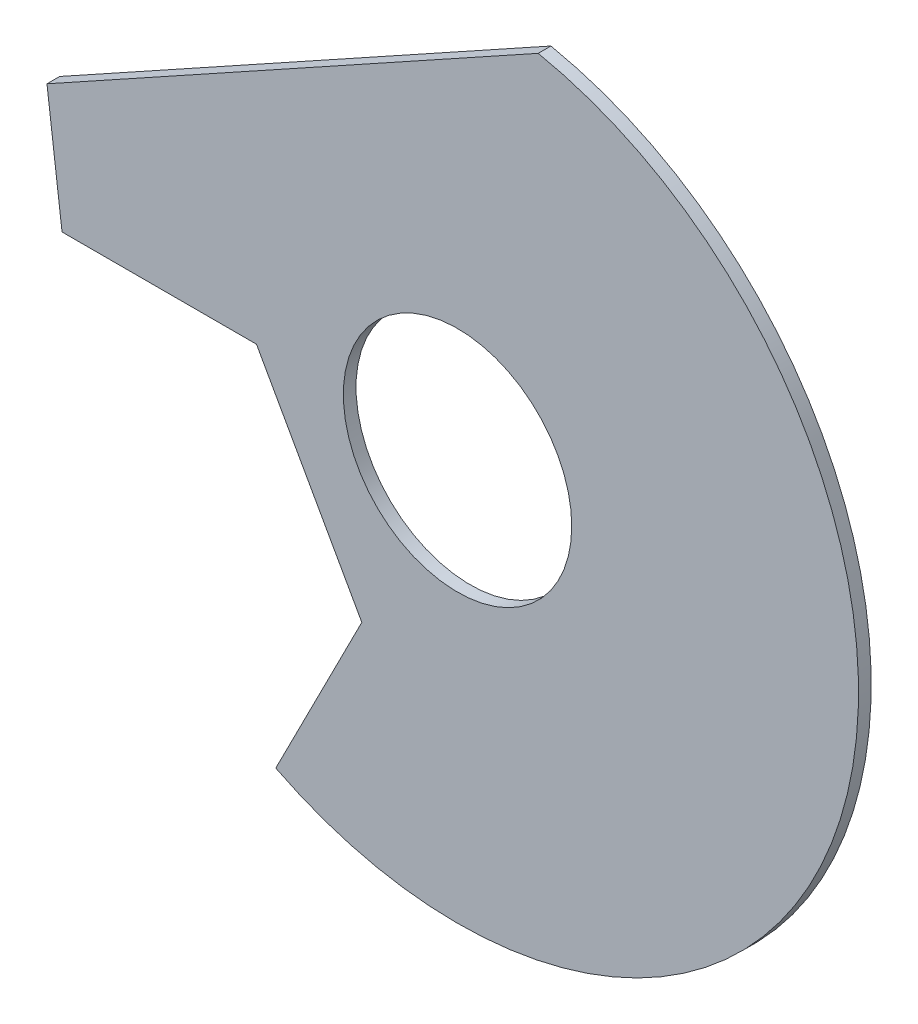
ISO-10303-21;
HEADER;
FILE_DESCRIPTION(('STEP AP214'),'2;1');
FILE_NAME('part.step','',(''),(''),'','','');
FILE_SCHEMA(('AUTOMOTIVE_DESIGN { 1 0 10303 214 1 1 1 1 }'));
ENDSEC;
DATA;
#1=APPLICATION_CONTEXT('core data for automotive mechanical design processes');
#2=APPLICATION_PROTOCOL_DEFINITION('international standard','automotive_design',2000,#1);
#3=PRODUCT_CONTEXT('',#1,'mechanical');
#4=PRODUCT('Part','Part','',(#3));
#5=PRODUCT_RELATED_PRODUCT_CATEGORY('part','',(#4));
#6=PRODUCT_DEFINITION_FORMATION('','',#4);
#7=PRODUCT_DEFINITION_CONTEXT('part definition',#1,'design');
#8=PRODUCT_DEFINITION('design','',#6,#7);
#9=PRODUCT_DEFINITION_SHAPE('','',#8);
#10=(LENGTH_UNIT() NAMED_UNIT(*) SI_UNIT(.MILLI.,.METRE.));
#11=(NAMED_UNIT(*) PLANE_ANGLE_UNIT() SI_UNIT($,.RADIAN.));
#12=(NAMED_UNIT(*) SI_UNIT($,.STERADIAN.) SOLID_ANGLE_UNIT());
#13=UNCERTAINTY_MEASURE_WITH_UNIT(LENGTH_MEASURE(1.E-05),#10,'distance_accuracy_value','');
#14=(GEOMETRIC_REPRESENTATION_CONTEXT(3) GLOBAL_UNCERTAINTY_ASSIGNED_CONTEXT((#13)) GLOBAL_UNIT_ASSIGNED_CONTEXT((#10,
#11,#12)) REPRESENTATION_CONTEXT('',''));
#15=CARTESIAN_POINT('',(0.,0.,0.));
#16=DIRECTION('',(0.,0.,1.));
#17=DIRECTION('',(1.,0.,0.));
#18=AXIS2_PLACEMENT_3D('',#15,#16,#17);
#19=CARTESIAN_POINT('',(38.9999999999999,43.5,0.5));
#20=DIRECTION('',(0.,0.,-1.));
#21=DIRECTION('',(-1.,0.,0.));
#22=AXIS2_PLACEMENT_3D('',#19,#20,#21);
#23=CYLINDRICAL_SURFACE('',#22,15.8);
#24=CARTESIAN_POINT('',(38.9999999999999,43.5,0.));
#25=DIRECTION('',(0.,0.,1.));
#26=DIRECTION('',(1.,0.,0.));
#27=AXIS2_PLACEMENT_3D('',#24,#25,#26);
#28=CIRCLE('',#27,15.8);
#29=CARTESIAN_POINT('',(31.8379965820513,29.4164739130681,0.));
#30=VERTEX_POINT('',#29);
#31=CARTESIAN_POINT('',(42.178843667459,58.9769167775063,0.));
#32=VERTEX_POINT('',#31);
#33=EDGE_CURVE('E120',#30,#32,#28,.T.);
#34=ORIENTED_EDGE('',*,*,#33,.T.);
#35=DIRECTION('',(0.,0.,-1.));
#36=VECTOR('',#35,1.);
#37=CARTESIAN_POINT('',(42.178843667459,58.9769167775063,0.5));
#38=LINE('',#37,#36);
#39=CARTESIAN_POINT('',(42.178843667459,58.9769167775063,0.5));
#40=VERTEX_POINT('',#39);
#41=EDGE_CURVE('E11',#40,#32,#38,.T.);
#42=ORIENTED_EDGE('',*,*,#41,.F.);
#43=CARTESIAN_POINT('',(38.9999999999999,43.5,0.5));
#44=DIRECTION('',(0.,0.,1.));
#45=DIRECTION('',(1.,0.,0.));
#46=AXIS2_PLACEMENT_3D('',#43,#44,#45);
#47=CIRCLE('',#46,15.8);
#48=CARTESIAN_POINT('',(31.8379965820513,29.4164739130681,0.5));
#49=VERTEX_POINT('',#48);
#50=EDGE_CURVE('E130',#49,#40,#47,.T.);
#51=ORIENTED_EDGE('',*,*,#50,.F.);
#52=DIRECTION('',(0.,0.,-1.));
#53=VECTOR('',#52,1.);
#54=CARTESIAN_POINT('',(31.8379965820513,29.4164739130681,0.5));
#55=LINE('',#54,#53);
#56=EDGE_CURVE('E116',#49,#30,#55,.T.);
#57=ORIENTED_EDGE('',*,*,#56,.T.);
#58=EDGE_LOOP('',(#34,#42,#51,#57));
#59=FACE_BOUND('',#58,.T.);
#60=ADVANCED_FACE('F35',(#59),#23,.T.);
#61=CARTESIAN_POINT('',(42.178843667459,58.9769167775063,0.5));
#62=DIRECTION('',(0.484408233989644,-0.874842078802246,0.));
#63=DIRECTION('',(0.874842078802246,0.484408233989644,0.));
#64=AXIS2_PLACEMENT_3D('',#61,#62,#63);
#65=PLANE('',#64);
#66=DIRECTION('',(-0.874842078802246,-0.484408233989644,0.));
#67=VECTOR('',#66,1.);
#68=CARTESIAN_POINT('',(42.178843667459,58.9769167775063,0.));
#69=LINE('',#68,#67);
#70=CARTESIAN_POINT('',(22.8230995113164,48.2594603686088,0.));
#71=VERTEX_POINT('',#70);
#72=EDGE_CURVE('E123',#32,#71,#69,.T.);
#73=ORIENTED_EDGE('',*,*,#72,.T.);
#74=DIRECTION('',(0.,0.,-1.));
#75=VECTOR('',#74,1.);
#76=CARTESIAN_POINT('',(22.8230995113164,48.2594603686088,0.5));
#77=LINE('',#76,#75);
#78=CARTESIAN_POINT('',(22.8230995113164,48.2594603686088,0.5));
#79=VERTEX_POINT('',#78);
#80=EDGE_CURVE('E44',#79,#71,#77,.T.);
#81=ORIENTED_EDGE('',*,*,#80,.F.);
#82=DIRECTION('',(-0.874842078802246,-0.484408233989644,0.));
#83=VECTOR('',#82,1.);
#84=CARTESIAN_POINT('',(42.178843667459,58.9769167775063,0.5));
#85=LINE('',#84,#83);
#86=EDGE_CURVE('E89',#40,#79,#85,.T.);
#87=ORIENTED_EDGE('',*,*,#86,.F.);
#88=ORIENTED_EDGE('',*,*,#41,.T.);
#89=EDGE_LOOP('',(#73,#81,#87,#88));
#90=FACE_BOUND('',#89,.T.);
#91=ADVANCED_FACE('F156',(#90),#65,.F.);
#92=CARTESIAN_POINT('',(22.8230995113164,48.2594603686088,0.5));
#93=DIRECTION('',(0.992312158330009,0.12376017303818,0.));
#94=DIRECTION('',(-0.12376017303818,0.992312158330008,0.));
#95=AXIS2_PLACEMENT_3D('',#92,#93,#94);
#96=PLANE('',#95);
#97=DIRECTION('',(0.12376017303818,-0.992312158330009,0.));
#98=VECTOR('',#97,1.);
#99=CARTESIAN_POINT('',(22.8230995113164,48.2594603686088,0.));
#100=LINE('',#99,#98);
#101=CARTESIAN_POINT('',(23.4166946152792,43.5,0.));
#102=VERTEX_POINT('',#101);
#103=EDGE_CURVE('E125',#71,#102,#100,.T.);
#104=ORIENTED_EDGE('',*,*,#103,.T.);
#105=DIRECTION('',(0.,0.,-1.));
#106=VECTOR('',#105,1.);
#107=CARTESIAN_POINT('',(23.4166946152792,43.5,0.5));
#108=LINE('',#107,#106);
#109=CARTESIAN_POINT('',(23.4166946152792,43.5,0.5));
#110=VERTEX_POINT('',#109);
#111=EDGE_CURVE('E111',#110,#102,#108,.T.);
#112=ORIENTED_EDGE('',*,*,#111,.F.);
#113=DIRECTION('',(0.12376017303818,-0.992312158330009,0.));
#114=VECTOR('',#113,1.);
#115=CARTESIAN_POINT('',(22.8230995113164,48.2594603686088,0.5));
#116=LINE('',#115,#114);
#117=EDGE_CURVE('E102',#79,#110,#116,.T.);
#118=ORIENTED_EDGE('',*,*,#117,.F.);
#119=ORIENTED_EDGE('',*,*,#80,.T.);
#120=EDGE_LOOP('',(#104,#112,#118,#119));
#121=FACE_BOUND('',#120,.T.);
#122=ADVANCED_FACE('F137',(#121),#96,.F.);
#123=CARTESIAN_POINT('',(23.4166946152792,43.5,0.5));
#124=DIRECTION('',(0.,1.,0.));
#125=DIRECTION('',(0.,0.,1.));
#126=AXIS2_PLACEMENT_3D('',#123,#124,#125);
#127=PLANE('',#126);
#128=DIRECTION('',(1.,0.,0.));
#129=VECTOR('',#128,1.);
#130=CARTESIAN_POINT('',(23.4166946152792,43.5,0.));
#131=LINE('',#130,#129);
#132=CARTESIAN_POINT('',(31.0786905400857,43.5,0.));
#133=VERTEX_POINT('',#132);
#134=EDGE_CURVE('E110',#102,#133,#131,.T.);
#135=ORIENTED_EDGE('',*,*,#134,.T.);
#136=DIRECTION('',(0.,0.,-1.));
#137=VECTOR('',#136,1.);
#138=CARTESIAN_POINT('',(31.0786905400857,43.5,0.5));
#139=LINE('',#138,#137);
#140=CARTESIAN_POINT('',(31.0786905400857,43.5,0.5));
#141=VERTEX_POINT('',#140);
#142=EDGE_CURVE('E107',#141,#133,#139,.T.);
#143=ORIENTED_EDGE('',*,*,#142,.F.);
#144=DIRECTION('',(1.,0.,0.));
#145=VECTOR('',#144,1.);
#146=CARTESIAN_POINT('',(23.4166946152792,43.5,0.5));
#147=LINE('',#146,#145);
#148=EDGE_CURVE('E96',#110,#141,#147,.T.);
#149=ORIENTED_EDGE('',*,*,#148,.F.);
#150=ORIENTED_EDGE('',*,*,#111,.T.);
#151=EDGE_LOOP('',(#135,#143,#149,#150));
#152=FACE_BOUND('',#151,.T.);
#153=ADVANCED_FACE('F108',(#152),#127,.F.);
#154=CARTESIAN_POINT('',(31.0786905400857,43.5,0.5));
#155=DIRECTION('',(0.872652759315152,0.488341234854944,0.));
#156=DIRECTION('',(-0.488341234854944,0.872652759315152,0.));
#157=AXIS2_PLACEMENT_3D('',#154,#155,#156);
#158=PLANE('',#157);
#159=DIRECTION('',(0.488341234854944,-0.872652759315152,0.));
#160=VECTOR('',#159,1.);
#161=CARTESIAN_POINT('',(31.0786905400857,43.5,0.));
#162=LINE('',#161,#160);
#163=CARTESIAN_POINT('',(35.2287036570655,36.0840372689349,0.));
#164=VERTEX_POINT('',#163);
#165=EDGE_CURVE('E75',#133,#164,#162,.T.);
#166=ORIENTED_EDGE('',*,*,#165,.T.);
#167=DIRECTION('',(0.,0.,-1.));
#168=VECTOR('',#167,1.);
#169=CARTESIAN_POINT('',(35.2287036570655,36.0840372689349,0.5));
#170=LINE('',#169,#168);
#171=CARTESIAN_POINT('',(35.2287036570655,36.0840372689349,0.5));
#172=VERTEX_POINT('',#171);
#173=EDGE_CURVE('E112',#172,#164,#170,.T.);
#174=ORIENTED_EDGE('',*,*,#173,.F.);
#175=DIRECTION('',(0.488341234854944,-0.872652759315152,0.));
#176=VECTOR('',#175,1.);
#177=CARTESIAN_POINT('',(31.0786905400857,43.5,0.5));
#178=LINE('',#177,#176);
#179=EDGE_CURVE('E100',#141,#172,#178,.T.);
#180=ORIENTED_EDGE('',*,*,#179,.F.);
#181=ORIENTED_EDGE('',*,*,#142,.T.);
#182=EDGE_LOOP('',(#166,#174,#180,#181));
#183=FACE_BOUND('',#182,.T.);
#184=ADVANCED_FACE('F114',(#183),#158,.F.);
#185=CARTESIAN_POINT('',(35.2287036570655,36.0840372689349,0.5));
#186=DIRECTION('',(0.891362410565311,-0.453291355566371,0.));
#187=DIRECTION('',(0.453291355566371,0.891362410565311,0.));
#188=AXIS2_PLACEMENT_3D('',#185,#186,#187);
#189=PLANE('',#188);
#190=DIRECTION('',(-0.453291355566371,-0.891362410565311,0.));
#191=VECTOR('',#190,1.);
#192=CARTESIAN_POINT('',(35.2287036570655,36.0840372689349,0.));
#193=LINE('',#192,#191);
#194=EDGE_CURVE('E81',#164,#30,#193,.T.);
#195=ORIENTED_EDGE('',*,*,#194,.T.);
#196=ORIENTED_EDGE('',*,*,#56,.F.);
#197=DIRECTION('',(-0.453291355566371,-0.891362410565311,0.));
#198=VECTOR('',#197,1.);
#199=CARTESIAN_POINT('',(35.2287036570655,36.0840372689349,0.5));
#200=LINE('',#199,#198);
#201=EDGE_CURVE('E52',#172,#49,#200,.T.);
#202=ORIENTED_EDGE('',*,*,#201,.F.);
#203=ORIENTED_EDGE('',*,*,#173,.T.);
#204=EDGE_LOOP('',(#195,#196,#202,#203));
#205=FACE_BOUND('',#204,.T.);
#206=ADVANCED_FACE('F144',(#205),#189,.F.);
#207=CARTESIAN_POINT('',(38.9999999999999,43.5,0.5));
#208=DIRECTION('',(0.,0.,1.));
#209=DIRECTION('',(1.,0.,0.));
#210=AXIS2_PLACEMENT_3D('',#207,#208,#209);
#211=PLANE('',#210);
#212=CARTESIAN_POINT('',(38.9999999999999,43.5,0.5));
#213=DIRECTION('',(0.,0.,1.));
#214=DIRECTION('',(1.,0.,0.));
#215=AXIS2_PLACEMENT_3D('',#212,#213,#214);
#216=CIRCLE('',#215,4.5);
#217=CARTESIAN_POINT('',(43.4999999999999,43.5,0.5));
#218=VERTEX_POINT('',#217);
#219=EDGE_CURVE('E209',#218,#218,#216,.T.);
#220=ORIENTED_EDGE('',*,*,#219,.F.);
#221=EDGE_LOOP('',(#220));
#222=FACE_BOUND('',#221,.T.);
#223=ORIENTED_EDGE('',*,*,#50,.T.);
#224=ORIENTED_EDGE('',*,*,#86,.T.);
#225=ORIENTED_EDGE('',*,*,#117,.T.);
#226=ORIENTED_EDGE('',*,*,#148,.T.);
#227=ORIENTED_EDGE('',*,*,#179,.T.);
#228=ORIENTED_EDGE('',*,*,#201,.T.);
#229=EDGE_LOOP('',(#223,#224,#225,#226,#227,#228));
#230=FACE_BOUND('',#229,.T.);
#231=ADVANCED_FACE('F98',(#222,#230),#211,.T.);
#232=CARTESIAN_POINT('',(38.9999999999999,43.5,0.));
#233=DIRECTION('',(0.,0.,1.));
#234=DIRECTION('',(1.,0.,0.));
#235=AXIS2_PLACEMENT_3D('',#232,#233,#234);
#236=PLANE('',#235);
#237=CARTESIAN_POINT('',(38.9999999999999,43.5,0.));
#238=DIRECTION('',(0.,0.,1.));
#239=DIRECTION('',(1.,0.,0.));
#240=AXIS2_PLACEMENT_3D('',#237,#238,#239);
#241=CIRCLE('',#240,4.5);
#242=CARTESIAN_POINT('',(43.4999999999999,43.5,0.));
#243=VERTEX_POINT('',#242);
#244=EDGE_CURVE('E38',#243,#243,#241,.T.);
#245=ORIENTED_EDGE('',*,*,#244,.T.);
#246=EDGE_LOOP('',(#245));
#247=FACE_BOUND('',#246,.T.);
#248=ORIENTED_EDGE('',*,*,#33,.F.);
#249=ORIENTED_EDGE('',*,*,#194,.F.);
#250=ORIENTED_EDGE('',*,*,#165,.F.);
#251=ORIENTED_EDGE('',*,*,#134,.F.);
#252=ORIENTED_EDGE('',*,*,#103,.F.);
#253=ORIENTED_EDGE('',*,*,#72,.F.);
#254=EDGE_LOOP('',(#248,#249,#250,#251,#252,#253));
#255=FACE_BOUND('',#254,.T.);
#256=ADVANCED_FACE('F140',(#247,#255),#236,.F.);
#257=CARTESIAN_POINT('',(38.9999999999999,43.5,-9.5));
#258=DIRECTION('',(0.,0.,1.));
#259=DIRECTION('',(1.,0.,0.));
#260=AXIS2_PLACEMENT_3D('',#257,#258,#259);
#261=CYLINDRICAL_SURFACE('',#260,4.5);
#262=ORIENTED_EDGE('',*,*,#219,.T.);
#263=EDGE_LOOP('',(#262));
#264=FACE_BOUND('',#263,.T.);
#265=ORIENTED_EDGE('',*,*,#244,.F.);
#266=EDGE_LOOP('',(#265));
#267=FACE_BOUND('',#266,.T.);
#268=ADVANCED_FACE('F193',(#264,#267),#261,.F.);
#269=CLOSED_SHELL('',(#60,#91,#122,#153,#184,#206,#231,#256,#268));
#270=MANIFOLD_SOLID_BREP('B2',#269);
#271=ADVANCED_BREP_SHAPE_REPRESENTATION('',(#18,#270),#14);
#272=SHAPE_DEFINITION_REPRESENTATION(#9,#271);
ENDSEC;
END-ISO-10303-21;
